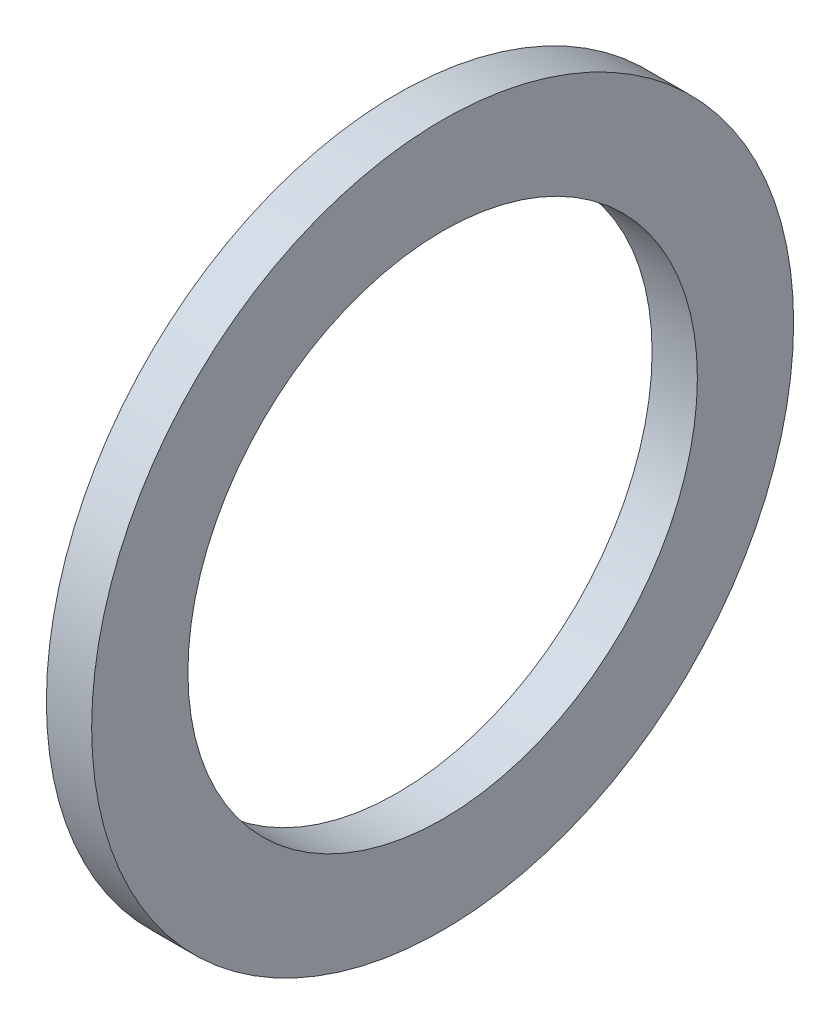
from build123d import *

# Parameters (mm, degrees)
ESQUISSE1_R          = 15.5
ESQUISSE1_R_2        = 11.25
BASE_EXTRUSION_DEPTH = 2


with BuildPart() as part:
    # Esquisse1 → Base-Extrusion (new body)
    with BuildSketch(Plane(origin=(0, 0, 0), x_dir=(0, 0, -1), z_dir=(1, 0, 0))):
        Circle(ESQUISSE1_R)
        Circle(ESQUISSE1_R_2, mode=Mode.SUBTRACT)
    extrude(amount=BASE_EXTRUSION_DEPTH)


solid = part.part
